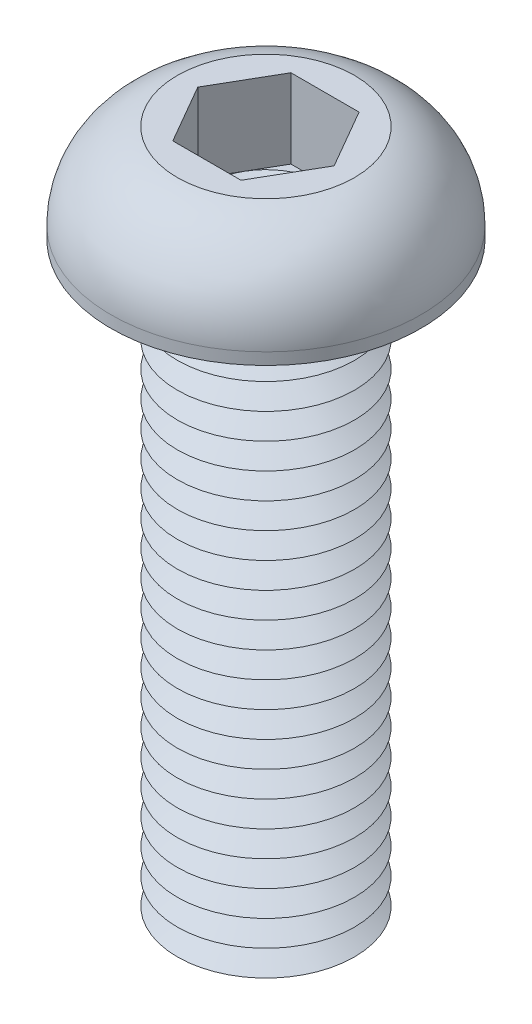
ISO-10303-21;
HEADER;
FILE_DESCRIPTION(('STEP AP214'),'2;1');
FILE_NAME('part.step','',(''),(''),'','','');
FILE_SCHEMA(('AUTOMOTIVE_DESIGN { 1 0 10303 214 1 1 1 1 }'));
ENDSEC;
DATA;
#1=APPLICATION_CONTEXT('core data for automotive mechanical design processes');
#2=APPLICATION_PROTOCOL_DEFINITION('international standard','automotive_design',2000,#1);
#3=PRODUCT_CONTEXT('',#1,'mechanical');
#4=PRODUCT('Part','Part','',(#3));
#5=PRODUCT_RELATED_PRODUCT_CATEGORY('part','',(#4));
#6=PRODUCT_DEFINITION_FORMATION('','',#4);
#7=PRODUCT_DEFINITION_CONTEXT('part definition',#1,'design');
#8=PRODUCT_DEFINITION('design','',#6,#7);
#9=PRODUCT_DEFINITION_SHAPE('','',#8);
#10=(LENGTH_UNIT() NAMED_UNIT(*) SI_UNIT(.MILLI.,.METRE.));
#11=(NAMED_UNIT(*) PLANE_ANGLE_UNIT() SI_UNIT($,.RADIAN.));
#12=(NAMED_UNIT(*) SI_UNIT($,.STERADIAN.) SOLID_ANGLE_UNIT());
#13=UNCERTAINTY_MEASURE_WITH_UNIT(LENGTH_MEASURE(1.E-05),#10,'distance_accuracy_value','');
#14=(GEOMETRIC_REPRESENTATION_CONTEXT(3) GLOBAL_UNCERTAINTY_ASSIGNED_CONTEXT((#13)) GLOBAL_UNIT_ASSIGNED_CONTEXT((#10,
#11,#12)) REPRESENTATION_CONTEXT('',''));
#15=CARTESIAN_POINT('',(0.,0.,0.));
#16=DIRECTION('',(0.,0.,1.));
#17=DIRECTION('',(1.,0.,0.));
#18=AXIS2_PLACEMENT_3D('',#15,#16,#17);
#19=CARTESIAN_POINT('',(0.,0.,0.));
#20=DIRECTION('',(0.,-1.,0.));
#21=DIRECTION('',(0.,0.,-1.));
#22=AXIS2_PLACEMENT_3D('',#19,#20,#21);
#23=TOROIDAL_SURFACE('',#22,6.875,0.875);
#24=CARTESIAN_POINT('',(0.,0.,-7.75));
#25=VERTEX_POINT('',#24);
#26=VERTEX_LOOP('',#25);
#27=FACE_BOUND('',#26,.T.);
#28=ADVANCED_FACE('P0_F12',(#27),#23,.T.);
#29=CLOSED_SHELL('',(#28));
#30=MANIFOLD_SOLID_BREP('P0_B1',#29);
#31=CARTESIAN_POINT('',(2.3094010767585,1.24,-4.));
#32=DIRECTION('',(0.,1.,0.));
#33=DIRECTION('',(0.,0.,1.));
#34=AXIS2_PLACEMENT_3D('',#31,#32,#33);
#35=PLANE('',#34);
#36=CARTESIAN_POINT('',(0.,1.24,0.));
#37=DIRECTION('',(0.,1.,0.));
#38=DIRECTION('',(0.,0.,1.));
#39=AXIS2_PLACEMENT_3D('',#36,#37,#38);
#40=CIRCLE('',#39,4.);
#41=CARTESIAN_POINT('',(0.,1.24,4.));
#42=VERTEX_POINT('',#41);
#43=CARTESIAN_POINT('',(3.46410161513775,1.24,2.));
#44=VERTEX_POINT('',#43);
#45=EDGE_CURVE('P1_E93',#42,#44,#40,.T.);
#46=ORIENTED_EDGE('',*,*,#45,.F.);
#47=DIRECTION('',(1.,0.,0.));
#48=VECTOR('',#47,1.);
#49=CARTESIAN_POINT('',(-2.3094010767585,1.24,4.));
#50=LINE('',#49,#48);
#51=CARTESIAN_POINT('',(2.3094010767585,1.24,4.));
#52=VERTEX_POINT('',#51);
#53=EDGE_CURVE('P1_E116',#42,#52,#50,.T.);
#54=ORIENTED_EDGE('',*,*,#53,.T.);
#55=DIRECTION('',(0.5,0.,-0.866025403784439));
#56=VECTOR('',#55,1.);
#57=CARTESIAN_POINT('',(2.3094010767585,1.24,4.));
#58=LINE('',#57,#56);
#59=EDGE_CURVE('P1_E112',#52,#44,#58,.T.);
#60=ORIENTED_EDGE('',*,*,#59,.T.);
#61=EDGE_LOOP('',(#46,#54,#60));
#62=FACE_BOUND('',#61,.T.);
#63=ADVANCED_FACE('P1_F15',(#62),#35,.T.);
#64=CARTESIAN_POINT('',(0.,1.24,0.));
#65=DIRECTION('',(0.,1.,0.));
#66=DIRECTION('',(0.,0.,1.));
#67=AXIS2_PLACEMENT_3D('',#64,#65,#66);
#68=CIRCLE('',#67,4.);
#69=CARTESIAN_POINT('',(3.46410161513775,1.24,-2.));
#70=VERTEX_POINT('',#69);
#71=EDGE_CURVE('P1_E10',#44,#70,#68,.T.);
#72=ORIENTED_EDGE('',*,*,#71,.F.);
#73=CARTESIAN_POINT('',(4.61880215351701,1.24,0.));
#74=VERTEX_POINT('',#73);
#75=EDGE_CURVE('P1_E104',#44,#74,#58,.T.);
#76=ORIENTED_EDGE('',*,*,#75,.T.);
#77=DIRECTION('',(-0.5,0.,-0.866025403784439));
#78=VECTOR('',#77,1.);
#79=CARTESIAN_POINT('',(4.61880215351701,1.24,0.));
#80=LINE('',#79,#78);
#81=EDGE_CURVE('P1_E107',#74,#70,#80,.T.);
#82=ORIENTED_EDGE('',*,*,#81,.T.);
#83=EDGE_LOOP('',(#72,#76,#82));
#84=FACE_BOUND('',#83,.T.);
#85=ADVANCED_FACE('P1_F103',(#84),#35,.T.);
#86=CARTESIAN_POINT('',(0.,1.24,-4.));
#87=VERTEX_POINT('',#86);
#88=EDGE_CURVE('P1_E24',#70,#87,#68,.T.);
#89=ORIENTED_EDGE('',*,*,#88,.F.);
#90=CARTESIAN_POINT('',(2.3094010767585,1.24,-4.));
#91=VERTEX_POINT('',#90);
#92=EDGE_CURVE('P1_E139',#70,#91,#80,.T.);
#93=ORIENTED_EDGE('',*,*,#92,.T.);
#94=DIRECTION('',(-1.,0.,0.));
#95=VECTOR('',#94,1.);
#96=CARTESIAN_POINT('',(2.3094010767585,1.24,-4.));
#97=LINE('',#96,#95);
#98=EDGE_CURVE('P1_E354',#91,#87,#97,.T.);
#99=ORIENTED_EDGE('',*,*,#98,.T.);
#100=EDGE_LOOP('',(#89,#93,#99));
#101=FACE_BOUND('',#100,.T.);
#102=ADVANCED_FACE('P1_F319',(#101),#35,.T.);
#103=CARTESIAN_POINT('',(-3.46410161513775,1.24,-2.));
#104=VERTEX_POINT('',#103);
#105=EDGE_CURVE('P1_E349',#87,#104,#68,.T.);
#106=ORIENTED_EDGE('',*,*,#105,.F.);
#107=CARTESIAN_POINT('',(-2.3094010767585,1.24,-4.));
#108=VERTEX_POINT('',#107);
#109=EDGE_CURVE('P1_E358',#87,#108,#97,.T.);
#110=ORIENTED_EDGE('',*,*,#109,.T.);
#111=DIRECTION('',(-0.5,0.,0.866025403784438));
#112=VECTOR('',#111,1.);
#113=CARTESIAN_POINT('',(-2.3094010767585,1.24,-4.));
#114=LINE('',#113,#112);
#115=EDGE_CURVE('P1_E353',#108,#104,#114,.T.);
#116=ORIENTED_EDGE('',*,*,#115,.T.);
#117=EDGE_LOOP('',(#106,#110,#116));
#118=FACE_BOUND('',#117,.T.);
#119=ADVANCED_FACE('P1_F333',(#118),#35,.T.);
#120=CARTESIAN_POINT('',(-3.46410161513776,1.24,2.));
#121=VERTEX_POINT('',#120);
#122=EDGE_CURVE('P1_E31',#104,#121,#68,.T.);
#123=ORIENTED_EDGE('',*,*,#122,.F.);
#124=CARTESIAN_POINT('',(-4.61880215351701,1.24,0.));
#125=VERTEX_POINT('',#124);
#126=EDGE_CURVE('P1_E345',#104,#125,#114,.T.);
#127=ORIENTED_EDGE('',*,*,#126,.T.);
#128=DIRECTION('',(0.5,0.,0.866025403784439));
#129=VECTOR('',#128,1.);
#130=CARTESIAN_POINT('',(-4.61880215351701,1.24,0.));
#131=LINE('',#130,#129);
#132=EDGE_CURVE('P1_E348',#125,#121,#131,.T.);
#133=ORIENTED_EDGE('',*,*,#132,.T.);
#134=EDGE_LOOP('',(#123,#127,#133));
#135=FACE_BOUND('',#134,.T.);
#136=ADVANCED_FACE('P1_F324',(#135),#35,.T.);
#137=CARTESIAN_POINT('',(0.,-38.25,0.));
#138=DIRECTION('',(0.,1.,0.));
#139=DIRECTION('',(0.,0.,1.));
#140=AXIS2_PLACEMENT_3D('',#137,#138,#139);
#141=CONICAL_SURFACE('',#140,4.48445554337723,1.0471975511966);
#142=CARTESIAN_POINT('',(0.,-37.375,0.));
#143=DIRECTION('',(0.,-1.,0.));
#144=DIRECTION('',(0.,0.,-1.));
#145=AXIS2_PLACEMENT_3D('',#142,#143,#144);
#146=CIRCLE('',#145,6.);
#147=CARTESIAN_POINT('',(0.,-37.375,-6.));
#148=VERTEX_POINT('',#147);
#149=EDGE_CURVE('P1_E281',#148,#148,#146,.T.);
#150=ORIENTED_EDGE('',*,*,#149,.T.);
#151=EDGE_LOOP('',(#150));
#152=FACE_BOUND('',#151,.T.);
#153=CARTESIAN_POINT('',(0.,-38.25,0.));
#154=DIRECTION('',(0.,-1.,0.));
#155=DIRECTION('',(0.,0.,-1.));
#156=AXIS2_PLACEMENT_3D('',#153,#154,#155);
#157=CIRCLE('',#156,4.48445554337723);
#158=CARTESIAN_POINT('',(0.,-38.25,-4.48445554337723));
#159=VERTEX_POINT('',#158);
#160=EDGE_CURVE('P1_E284',#159,#159,#157,.T.);
#161=ORIENTED_EDGE('',*,*,#160,.F.);
#162=EDGE_LOOP('',(#161));
#163=FACE_BOUND('',#162,.T.);
#164=ADVANCED_FACE('P1_F332',(#152,#163),#141,.T.);
#165=CARTESIAN_POINT('',(0.,-39.125,0.));
#166=DIRECTION('',(0.,-1.,0.));
#167=DIRECTION('',(0.,0.,-1.));
#168=AXIS2_PLACEMENT_3D('',#165,#166,#167);
#169=CONICAL_SURFACE('',#168,6.,1.0471975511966);
#170=ORIENTED_EDGE('',*,*,#160,.T.);
#171=EDGE_LOOP('',(#170));
#172=FACE_BOUND('',#171,.T.);
#173=CARTESIAN_POINT('',(0.,-39.125,0.));
#174=DIRECTION('',(0.,-1.,0.));
#175=DIRECTION('',(0.,0.,-1.));
#176=AXIS2_PLACEMENT_3D('',#173,#174,#175);
#177=CIRCLE('',#176,6.);
#178=CARTESIAN_POINT('',(0.,-39.125,-6.));
#179=VERTEX_POINT('',#178);
#180=EDGE_CURVE('P1_E287',#179,#179,#177,.T.);
#181=ORIENTED_EDGE('',*,*,#180,.F.);
#182=EDGE_LOOP('',(#181));
#183=FACE_BOUND('',#182,.T.);
#184=ADVANCED_FACE('P1_F339',(#172,#183),#169,.T.);
#185=CARTESIAN_POINT('',(0.,-40.,0.));
#186=DIRECTION('',(0.,1.,0.));
#187=DIRECTION('',(0.,0.,1.));
#188=AXIS2_PLACEMENT_3D('',#185,#186,#187);
#189=PLANE('',#188);
#190=CARTESIAN_POINT('',(0.,-40.,0.));
#191=DIRECTION('',(0.,-1.,0.));
#192=DIRECTION('',(0.,0.,-1.));
#193=AXIS2_PLACEMENT_3D('',#190,#191,#192);
#194=CIRCLE('',#193,4.48445554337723);
#195=CARTESIAN_POINT('',(0.,-40.,-4.48445554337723));
#196=VERTEX_POINT('',#195);
#197=EDGE_CURVE('P1_E290',#196,#196,#194,.T.);
#198=ORIENTED_EDGE('',*,*,#197,.T.);
#199=EDGE_LOOP('',(#198));
#200=FACE_BOUND('',#199,.T.);
#201=ADVANCED_FACE('P1_F417',(#200),#189,.F.);
#202=CARTESIAN_POINT('',(0.,-40.,0.));
#203=DIRECTION('',(0.,1.,0.));
#204=DIRECTION('',(0.,0.,1.));
#205=AXIS2_PLACEMENT_3D('',#202,#203,#204);
#206=CONICAL_SURFACE('',#205,4.48445554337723,1.0471975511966);
#207=ORIENTED_EDGE('',*,*,#180,.T.);
#208=EDGE_LOOP('',(#207));
#209=FACE_BOUND('',#208,.T.);
#210=ORIENTED_EDGE('',*,*,#197,.F.);
#211=EDGE_LOOP('',(#210));
#212=FACE_BOUND('',#211,.T.);
#213=ADVANCED_FACE('P1_F428',(#209,#212),#206,.T.);
#214=CARTESIAN_POINT('',(0.,-36.5,0.));
#215=DIRECTION('',(0.,1.,0.));
#216=DIRECTION('',(0.,0.,1.));
#217=AXIS2_PLACEMENT_3D('',#214,#215,#216);
#218=CONICAL_SURFACE('',#217,4.48445554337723,1.0471975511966);
#219=CARTESIAN_POINT('',(0.,-35.625,0.));
#220=DIRECTION('',(0.,-1.,0.));
#221=DIRECTION('',(0.,0.,-1.));
#222=AXIS2_PLACEMENT_3D('',#219,#220,#221);
#223=CIRCLE('',#222,6.);
#224=CARTESIAN_POINT('',(0.,-35.625,-6.));
#225=VERTEX_POINT('',#224);
#226=EDGE_CURVE('P1_E275',#225,#225,#223,.T.);
#227=ORIENTED_EDGE('',*,*,#226,.T.);
#228=EDGE_LOOP('',(#227));
#229=FACE_BOUND('',#228,.T.);
#230=CARTESIAN_POINT('',(0.,-36.5,0.));
#231=DIRECTION('',(0.,-1.,0.));
#232=DIRECTION('',(0.,0.,-1.));
#233=AXIS2_PLACEMENT_3D('',#230,#231,#232);
#234=CIRCLE('',#233,4.48445554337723);
#235=CARTESIAN_POINT('',(0.,-36.5,-4.48445554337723));
#236=VERTEX_POINT('',#235);
#237=EDGE_CURVE('P1_E278',#236,#236,#234,.T.);
#238=ORIENTED_EDGE('',*,*,#237,.F.);
#239=EDGE_LOOP('',(#238));
#240=FACE_BOUND('',#239,.T.);
#241=ADVANCED_FACE('P1_F437',(#229,#240),#218,.T.);
#242=CARTESIAN_POINT('',(0.,-37.375,0.));
#243=DIRECTION('',(0.,-1.,0.));
#244=DIRECTION('',(0.,0.,-1.));
#245=AXIS2_PLACEMENT_3D('',#242,#243,#244);
#246=CONICAL_SURFACE('',#245,6.,1.0471975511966);
#247=ORIENTED_EDGE('',*,*,#237,.T.);
#248=EDGE_LOOP('',(#247));
#249=FACE_BOUND('',#248,.T.);
#250=ORIENTED_EDGE('',*,*,#149,.F.);
#251=EDGE_LOOP('',(#250));
#252=FACE_BOUND('',#251,.T.);
#253=ADVANCED_FACE('P1_F446',(#249,#252),#246,.T.);
#254=CARTESIAN_POINT('',(0.,-34.75,0.));
#255=DIRECTION('',(0.,1.,0.));
#256=DIRECTION('',(0.,0.,1.));
#257=AXIS2_PLACEMENT_3D('',#254,#255,#256);
#258=CONICAL_SURFACE('',#257,4.48445554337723,1.0471975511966);
#259=CARTESIAN_POINT('',(0.,-33.875,0.));
#260=DIRECTION('',(0.,-1.,0.));
#261=DIRECTION('',(0.,0.,-1.));
#262=AXIS2_PLACEMENT_3D('',#259,#260,#261);
#263=CIRCLE('',#262,6.);
#264=CARTESIAN_POINT('',(0.,-33.875,-6.));
#265=VERTEX_POINT('',#264);
#266=EDGE_CURVE('P1_E269',#265,#265,#263,.T.);
#267=ORIENTED_EDGE('',*,*,#266,.T.);
#268=EDGE_LOOP('',(#267));
#269=FACE_BOUND('',#268,.T.);
#270=CARTESIAN_POINT('',(0.,-34.75,0.));
#271=DIRECTION('',(0.,-1.,0.));
#272=DIRECTION('',(0.,0.,-1.));
#273=AXIS2_PLACEMENT_3D('',#270,#271,#272);
#274=CIRCLE('',#273,4.48445554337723);
#275=CARTESIAN_POINT('',(0.,-34.75,-4.48445554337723));
#276=VERTEX_POINT('',#275);
#277=EDGE_CURVE('P1_E272',#276,#276,#274,.T.);
#278=ORIENTED_EDGE('',*,*,#277,.F.);
#279=EDGE_LOOP('',(#278));
#280=FACE_BOUND('',#279,.T.);
#281=ADVANCED_FACE('P1_F456',(#269,#280),#258,.T.);
#282=CARTESIAN_POINT('',(0.,-35.625,0.));
#283=DIRECTION('',(0.,-1.,0.));
#284=DIRECTION('',(0.,0.,-1.));
#285=AXIS2_PLACEMENT_3D('',#282,#283,#284);
#286=CONICAL_SURFACE('',#285,6.,1.0471975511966);
#287=ORIENTED_EDGE('',*,*,#277,.T.);
#288=EDGE_LOOP('',(#287));
#289=FACE_BOUND('',#288,.T.);
#290=ORIENTED_EDGE('',*,*,#226,.F.);
#291=EDGE_LOOP('',(#290));
#292=FACE_BOUND('',#291,.T.);
#293=ADVANCED_FACE('P1_F466',(#289,#292),#286,.T.);
#294=CARTESIAN_POINT('',(0.,-33.,0.));
#295=DIRECTION('',(0.,1.,0.));
#296=DIRECTION('',(0.,0.,1.));
#297=AXIS2_PLACEMENT_3D('',#294,#295,#296);
#298=CONICAL_SURFACE('',#297,4.48445554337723,1.0471975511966);
#299=CARTESIAN_POINT('',(0.,-32.125,0.));
#300=DIRECTION('',(0.,-1.,0.));
#301=DIRECTION('',(0.,0.,-1.));
#302=AXIS2_PLACEMENT_3D('',#299,#300,#301);
#303=CIRCLE('',#302,6.);
#304=CARTESIAN_POINT('',(0.,-32.125,-6.));
#305=VERTEX_POINT('',#304);
#306=EDGE_CURVE('P1_E263',#305,#305,#303,.T.);
#307=ORIENTED_EDGE('',*,*,#306,.T.);
#308=EDGE_LOOP('',(#307));
#309=FACE_BOUND('',#308,.T.);
#310=CARTESIAN_POINT('',(0.,-33.,0.));
#311=DIRECTION('',(0.,-1.,0.));
#312=DIRECTION('',(0.,0.,-1.));
#313=AXIS2_PLACEMENT_3D('',#310,#311,#312);
#314=CIRCLE('',#313,4.48445554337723);
#315=CARTESIAN_POINT('',(0.,-33.,-4.48445554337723));
#316=VERTEX_POINT('',#315);
#317=EDGE_CURVE('P1_E266',#316,#316,#314,.T.);
#318=ORIENTED_EDGE('',*,*,#317,.F.);
#319=EDGE_LOOP('',(#318));
#320=FACE_BOUND('',#319,.T.);
#321=ADVANCED_FACE('P1_F476',(#309,#320),#298,.T.);
#322=CARTESIAN_POINT('',(0.,-33.875,0.));
#323=DIRECTION('',(0.,-1.,0.));
#324=DIRECTION('',(0.,0.,-1.));
#325=AXIS2_PLACEMENT_3D('',#322,#323,#324);
#326=CONICAL_SURFACE('',#325,6.,1.0471975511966);
#327=ORIENTED_EDGE('',*,*,#317,.T.);
#328=EDGE_LOOP('',(#327));
#329=FACE_BOUND('',#328,.T.);
#330=ORIENTED_EDGE('',*,*,#266,.F.);
#331=EDGE_LOOP('',(#330));
#332=FACE_BOUND('',#331,.T.);
#333=ADVANCED_FACE('P1_F486',(#329,#332),#326,.T.);
#334=CARTESIAN_POINT('',(0.,-31.25,0.));
#335=DIRECTION('',(0.,1.,0.));
#336=DIRECTION('',(0.,0.,1.));
#337=AXIS2_PLACEMENT_3D('',#334,#335,#336);
#338=CONICAL_SURFACE('',#337,4.48445554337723,1.0471975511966);
#339=CARTESIAN_POINT('',(0.,-30.375,0.));
#340=DIRECTION('',(0.,-1.,0.));
#341=DIRECTION('',(0.,0.,-1.));
#342=AXIS2_PLACEMENT_3D('',#339,#340,#341);
#343=CIRCLE('',#342,6.);
#344=CARTESIAN_POINT('',(0.,-30.375,-6.));
#345=VERTEX_POINT('',#344);
#346=EDGE_CURVE('P1_E257',#345,#345,#343,.T.);
#347=ORIENTED_EDGE('',*,*,#346,.T.);
#348=EDGE_LOOP('',(#347));
#349=FACE_BOUND('',#348,.T.);
#350=CARTESIAN_POINT('',(0.,-31.25,0.));
#351=DIRECTION('',(0.,-1.,0.));
#352=DIRECTION('',(0.,0.,-1.));
#353=AXIS2_PLACEMENT_3D('',#350,#351,#352);
#354=CIRCLE('',#353,4.48445554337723);
#355=CARTESIAN_POINT('',(0.,-31.25,-4.48445554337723));
#356=VERTEX_POINT('',#355);
#357=EDGE_CURVE('P1_E260',#356,#356,#354,.T.);
#358=ORIENTED_EDGE('',*,*,#357,.F.);
#359=EDGE_LOOP('',(#358));
#360=FACE_BOUND('',#359,.T.);
#361=ADVANCED_FACE('P1_F496',(#349,#360),#338,.T.);
#362=CARTESIAN_POINT('',(0.,-32.125,0.));
#363=DIRECTION('',(0.,-1.,0.));
#364=DIRECTION('',(0.,0.,-1.));
#365=AXIS2_PLACEMENT_3D('',#362,#363,#364);
#366=CONICAL_SURFACE('',#365,6.,1.0471975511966);
#367=ORIENTED_EDGE('',*,*,#357,.T.);
#368=EDGE_LOOP('',(#367));
#369=FACE_BOUND('',#368,.T.);
#370=ORIENTED_EDGE('',*,*,#306,.F.);
#371=EDGE_LOOP('',(#370));
#372=FACE_BOUND('',#371,.T.);
#373=ADVANCED_FACE('P1_F506',(#369,#372),#366,.T.);
#374=CARTESIAN_POINT('',(0.,-29.5,0.));
#375=DIRECTION('',(0.,1.,0.));
#376=DIRECTION('',(0.,0.,1.));
#377=AXIS2_PLACEMENT_3D('',#374,#375,#376);
#378=CONICAL_SURFACE('',#377,4.48445554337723,1.0471975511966);
#379=CARTESIAN_POINT('',(0.,-28.625,0.));
#380=DIRECTION('',(0.,-1.,0.));
#381=DIRECTION('',(0.,0.,-1.));
#382=AXIS2_PLACEMENT_3D('',#379,#380,#381);
#383=CIRCLE('',#382,6.);
#384=CARTESIAN_POINT('',(0.,-28.625,-6.));
#385=VERTEX_POINT('',#384);
#386=EDGE_CURVE('P1_E251',#385,#385,#383,.T.);
#387=ORIENTED_EDGE('',*,*,#386,.T.);
#388=EDGE_LOOP('',(#387));
#389=FACE_BOUND('',#388,.T.);
#390=CARTESIAN_POINT('',(0.,-29.5,0.));
#391=DIRECTION('',(0.,-1.,0.));
#392=DIRECTION('',(0.,0.,-1.));
#393=AXIS2_PLACEMENT_3D('',#390,#391,#392);
#394=CIRCLE('',#393,4.48445554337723);
#395=CARTESIAN_POINT('',(0.,-29.5,-4.48445554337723));
#396=VERTEX_POINT('',#395);
#397=EDGE_CURVE('P1_E254',#396,#396,#394,.T.);
#398=ORIENTED_EDGE('',*,*,#397,.F.);
#399=EDGE_LOOP('',(#398));
#400=FACE_BOUND('',#399,.T.);
#401=ADVANCED_FACE('P1_F516',(#389,#400),#378,.T.);
#402=CARTESIAN_POINT('',(0.,-30.375,0.));
#403=DIRECTION('',(0.,-1.,0.));
#404=DIRECTION('',(0.,0.,-1.));
#405=AXIS2_PLACEMENT_3D('',#402,#403,#404);
#406=CONICAL_SURFACE('',#405,6.,1.0471975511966);
#407=ORIENTED_EDGE('',*,*,#397,.T.);
#408=EDGE_LOOP('',(#407));
#409=FACE_BOUND('',#408,.T.);
#410=ORIENTED_EDGE('',*,*,#346,.F.);
#411=EDGE_LOOP('',(#410));
#412=FACE_BOUND('',#411,.T.);
#413=ADVANCED_FACE('P1_F526',(#409,#412),#406,.T.);
#414=CARTESIAN_POINT('',(0.,-27.75,0.));
#415=DIRECTION('',(0.,1.,0.));
#416=DIRECTION('',(0.,0.,1.));
#417=AXIS2_PLACEMENT_3D('',#414,#415,#416);
#418=CONICAL_SURFACE('',#417,4.48445554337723,1.0471975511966);
#419=CARTESIAN_POINT('',(0.,-26.875,0.));
#420=DIRECTION('',(0.,-1.,0.));
#421=DIRECTION('',(0.,0.,-1.));
#422=AXIS2_PLACEMENT_3D('',#419,#420,#421);
#423=CIRCLE('',#422,6.);
#424=CARTESIAN_POINT('',(0.,-26.875,-6.));
#425=VERTEX_POINT('',#424);
#426=EDGE_CURVE('P1_E245',#425,#425,#423,.T.);
#427=ORIENTED_EDGE('',*,*,#426,.T.);
#428=EDGE_LOOP('',(#427));
#429=FACE_BOUND('',#428,.T.);
#430=CARTESIAN_POINT('',(0.,-27.75,0.));
#431=DIRECTION('',(0.,-1.,0.));
#432=DIRECTION('',(0.,0.,-1.));
#433=AXIS2_PLACEMENT_3D('',#430,#431,#432);
#434=CIRCLE('',#433,4.48445554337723);
#435=CARTESIAN_POINT('',(0.,-27.75,-4.48445554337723));
#436=VERTEX_POINT('',#435);
#437=EDGE_CURVE('P1_E248',#436,#436,#434,.T.);
#438=ORIENTED_EDGE('',*,*,#437,.F.);
#439=EDGE_LOOP('',(#438));
#440=FACE_BOUND('',#439,.T.);
#441=ADVANCED_FACE('P1_F536',(#429,#440),#418,.T.);
#442=CARTESIAN_POINT('',(0.,-28.625,0.));
#443=DIRECTION('',(0.,-1.,0.));
#444=DIRECTION('',(0.,0.,-1.));
#445=AXIS2_PLACEMENT_3D('',#442,#443,#444);
#446=CONICAL_SURFACE('',#445,6.,1.0471975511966);
#447=ORIENTED_EDGE('',*,*,#437,.T.);
#448=EDGE_LOOP('',(#447));
#449=FACE_BOUND('',#448,.T.);
#450=ORIENTED_EDGE('',*,*,#386,.F.);
#451=EDGE_LOOP('',(#450));
#452=FACE_BOUND('',#451,.T.);
#453=ADVANCED_FACE('P1_F546',(#449,#452),#446,.T.);
#454=CARTESIAN_POINT('',(0.,-26.,0.));
#455=DIRECTION('',(0.,1.,0.));
#456=DIRECTION('',(0.,0.,1.));
#457=AXIS2_PLACEMENT_3D('',#454,#455,#456);
#458=CONICAL_SURFACE('',#457,4.48445554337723,1.0471975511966);
#459=CARTESIAN_POINT('',(0.,-25.125,0.));
#460=DIRECTION('',(0.,-1.,0.));
#461=DIRECTION('',(0.,0.,-1.));
#462=AXIS2_PLACEMENT_3D('',#459,#460,#461);
#463=CIRCLE('',#462,6.);
#464=CARTESIAN_POINT('',(0.,-25.125,-6.));
#465=VERTEX_POINT('',#464);
#466=EDGE_CURVE('P1_E239',#465,#465,#463,.T.);
#467=ORIENTED_EDGE('',*,*,#466,.T.);
#468=EDGE_LOOP('',(#467));
#469=FACE_BOUND('',#468,.T.);
#470=CARTESIAN_POINT('',(0.,-26.,0.));
#471=DIRECTION('',(0.,-1.,0.));
#472=DIRECTION('',(0.,0.,-1.));
#473=AXIS2_PLACEMENT_3D('',#470,#471,#472);
#474=CIRCLE('',#473,4.48445554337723);
#475=CARTESIAN_POINT('',(0.,-26.,-4.48445554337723));
#476=VERTEX_POINT('',#475);
#477=EDGE_CURVE('P1_E242',#476,#476,#474,.T.);
#478=ORIENTED_EDGE('',*,*,#477,.F.);
#479=EDGE_LOOP('',(#478));
#480=FACE_BOUND('',#479,.T.);
#481=ADVANCED_FACE('P1_F556',(#469,#480),#458,.T.);
#482=CARTESIAN_POINT('',(0.,-26.875,0.));
#483=DIRECTION('',(0.,-1.,0.));
#484=DIRECTION('',(0.,0.,-1.));
#485=AXIS2_PLACEMENT_3D('',#482,#483,#484);
#486=CONICAL_SURFACE('',#485,6.,1.0471975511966);
#487=ORIENTED_EDGE('',*,*,#477,.T.);
#488=EDGE_LOOP('',(#487));
#489=FACE_BOUND('',#488,.T.);
#490=ORIENTED_EDGE('',*,*,#426,.F.);
#491=EDGE_LOOP('',(#490));
#492=FACE_BOUND('',#491,.T.);
#493=ADVANCED_FACE('P1_F566',(#489,#492),#486,.T.);
#494=CARTESIAN_POINT('',(0.,-24.25,0.));
#495=DIRECTION('',(0.,1.,0.));
#496=DIRECTION('',(0.,0.,1.));
#497=AXIS2_PLACEMENT_3D('',#494,#495,#496);
#498=CONICAL_SURFACE('',#497,4.48445554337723,1.0471975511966);
#499=CARTESIAN_POINT('',(0.,-23.375,0.));
#500=DIRECTION('',(0.,-1.,0.));
#501=DIRECTION('',(0.,0.,-1.));
#502=AXIS2_PLACEMENT_3D('',#499,#500,#501);
#503=CIRCLE('',#502,6.);
#504=CARTESIAN_POINT('',(0.,-23.375,-6.));
#505=VERTEX_POINT('',#504);
#506=EDGE_CURVE('P1_E233',#505,#505,#503,.T.);
#507=ORIENTED_EDGE('',*,*,#506,.T.);
#508=EDGE_LOOP('',(#507));
#509=FACE_BOUND('',#508,.T.);
#510=CARTESIAN_POINT('',(0.,-24.25,0.));
#511=DIRECTION('',(0.,-1.,0.));
#512=DIRECTION('',(0.,0.,-1.));
#513=AXIS2_PLACEMENT_3D('',#510,#511,#512);
#514=CIRCLE('',#513,4.48445554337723);
#515=CARTESIAN_POINT('',(0.,-24.25,-4.48445554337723));
#516=VERTEX_POINT('',#515);
#517=EDGE_CURVE('P1_E236',#516,#516,#514,.T.);
#518=ORIENTED_EDGE('',*,*,#517,.F.);
#519=EDGE_LOOP('',(#518));
#520=FACE_BOUND('',#519,.T.);
#521=ADVANCED_FACE('P1_F576',(#509,#520),#498,.T.);
#522=CARTESIAN_POINT('',(0.,-25.125,0.));
#523=DIRECTION('',(0.,-1.,0.));
#524=DIRECTION('',(0.,0.,-1.));
#525=AXIS2_PLACEMENT_3D('',#522,#523,#524);
#526=CONICAL_SURFACE('',#525,6.,1.0471975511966);
#527=ORIENTED_EDGE('',*,*,#517,.T.);
#528=EDGE_LOOP('',(#527));
#529=FACE_BOUND('',#528,.T.);
#530=ORIENTED_EDGE('',*,*,#466,.F.);
#531=EDGE_LOOP('',(#530));
#532=FACE_BOUND('',#531,.T.);
#533=ADVANCED_FACE('P1_F586',(#529,#532),#526,.T.);
#534=CARTESIAN_POINT('',(0.,-22.5,0.));
#535=DIRECTION('',(0.,1.,0.));
#536=DIRECTION('',(0.,0.,1.));
#537=AXIS2_PLACEMENT_3D('',#534,#535,#536);
#538=CONICAL_SURFACE('',#537,4.48445554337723,1.0471975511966);
#539=CARTESIAN_POINT('',(0.,-21.625,0.));
#540=DIRECTION('',(0.,-1.,0.));
#541=DIRECTION('',(0.,0.,-1.));
#542=AXIS2_PLACEMENT_3D('',#539,#540,#541);
#543=CIRCLE('',#542,6.);
#544=CARTESIAN_POINT('',(0.,-21.625,-6.));
#545=VERTEX_POINT('',#544);
#546=EDGE_CURVE('P1_E227',#545,#545,#543,.T.);
#547=ORIENTED_EDGE('',*,*,#546,.T.);
#548=EDGE_LOOP('',(#547));
#549=FACE_BOUND('',#548,.T.);
#550=CARTESIAN_POINT('',(0.,-22.5,0.));
#551=DIRECTION('',(0.,-1.,0.));
#552=DIRECTION('',(0.,0.,-1.));
#553=AXIS2_PLACEMENT_3D('',#550,#551,#552);
#554=CIRCLE('',#553,4.48445554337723);
#555=CARTESIAN_POINT('',(0.,-22.5,-4.48445554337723));
#556=VERTEX_POINT('',#555);
#557=EDGE_CURVE('P1_E230',#556,#556,#554,.T.);
#558=ORIENTED_EDGE('',*,*,#557,.F.);
#559=EDGE_LOOP('',(#558));
#560=FACE_BOUND('',#559,.T.);
#561=ADVANCED_FACE('P1_F596',(#549,#560),#538,.T.);
#562=CARTESIAN_POINT('',(0.,-23.375,0.));
#563=DIRECTION('',(0.,-1.,0.));
#564=DIRECTION('',(0.,0.,-1.));
#565=AXIS2_PLACEMENT_3D('',#562,#563,#564);
#566=CONICAL_SURFACE('',#565,6.,1.0471975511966);
#567=ORIENTED_EDGE('',*,*,#557,.T.);
#568=EDGE_LOOP('',(#567));
#569=FACE_BOUND('',#568,.T.);
#570=ORIENTED_EDGE('',*,*,#506,.F.);
#571=EDGE_LOOP('',(#570));
#572=FACE_BOUND('',#571,.T.);
#573=ADVANCED_FACE('P1_F606',(#569,#572),#566,.T.);
#574=CARTESIAN_POINT('',(0.,-20.75,0.));
#575=DIRECTION('',(0.,1.,0.));
#576=DIRECTION('',(0.,0.,1.));
#577=AXIS2_PLACEMENT_3D('',#574,#575,#576);
#578=CONICAL_SURFACE('',#577,4.48445554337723,1.0471975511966);
#579=CARTESIAN_POINT('',(0.,-19.875,0.));
#580=DIRECTION('',(0.,-1.,0.));
#581=DIRECTION('',(0.,0.,-1.));
#582=AXIS2_PLACEMENT_3D('',#579,#580,#581);
#583=CIRCLE('',#582,6.);
#584=CARTESIAN_POINT('',(0.,-19.875,-6.));
#585=VERTEX_POINT('',#584);
#586=EDGE_CURVE('P1_E221',#585,#585,#583,.T.);
#587=ORIENTED_EDGE('',*,*,#586,.T.);
#588=EDGE_LOOP('',(#587));
#589=FACE_BOUND('',#588,.T.);
#590=CARTESIAN_POINT('',(0.,-20.75,0.));
#591=DIRECTION('',(0.,-1.,0.));
#592=DIRECTION('',(0.,0.,-1.));
#593=AXIS2_PLACEMENT_3D('',#590,#591,#592);
#594=CIRCLE('',#593,4.48445554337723);
#595=CARTESIAN_POINT('',(0.,-20.75,-4.48445554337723));
#596=VERTEX_POINT('',#595);
#597=EDGE_CURVE('P1_E224',#596,#596,#594,.T.);
#598=ORIENTED_EDGE('',*,*,#597,.F.);
#599=EDGE_LOOP('',(#598));
#600=FACE_BOUND('',#599,.T.);
#601=ADVANCED_FACE('P1_F616',(#589,#600),#578,.T.);
#602=CARTESIAN_POINT('',(0.,-21.625,0.));
#603=DIRECTION('',(0.,-1.,0.));
#604=DIRECTION('',(0.,0.,-1.));
#605=AXIS2_PLACEMENT_3D('',#602,#603,#604);
#606=CONICAL_SURFACE('',#605,6.,1.0471975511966);
#607=ORIENTED_EDGE('',*,*,#597,.T.);
#608=EDGE_LOOP('',(#607));
#609=FACE_BOUND('',#608,.T.);
#610=ORIENTED_EDGE('',*,*,#546,.F.);
#611=EDGE_LOOP('',(#610));
#612=FACE_BOUND('',#611,.T.);
#613=ADVANCED_FACE('P1_F626',(#609,#612),#606,.T.);
#614=CARTESIAN_POINT('',(0.,-19.,0.));
#615=DIRECTION('',(0.,1.,0.));
#616=DIRECTION('',(0.,0.,1.));
#617=AXIS2_PLACEMENT_3D('',#614,#615,#616);
#618=CONICAL_SURFACE('',#617,4.48445554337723,1.0471975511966);
#619=CARTESIAN_POINT('',(0.,-18.125,0.));
#620=DIRECTION('',(0.,-1.,0.));
#621=DIRECTION('',(0.,0.,-1.));
#622=AXIS2_PLACEMENT_3D('',#619,#620,#621);
#623=CIRCLE('',#622,6.);
#624=CARTESIAN_POINT('',(0.,-18.125,-6.));
#625=VERTEX_POINT('',#624);
#626=EDGE_CURVE('P1_E215',#625,#625,#623,.T.);
#627=ORIENTED_EDGE('',*,*,#626,.T.);
#628=EDGE_LOOP('',(#627));
#629=FACE_BOUND('',#628,.T.);
#630=CARTESIAN_POINT('',(0.,-19.,0.));
#631=DIRECTION('',(0.,-1.,0.));
#632=DIRECTION('',(0.,0.,-1.));
#633=AXIS2_PLACEMENT_3D('',#630,#631,#632);
#634=CIRCLE('',#633,4.48445554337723);
#635=CARTESIAN_POINT('',(0.,-19.,-4.48445554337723));
#636=VERTEX_POINT('',#635);
#637=EDGE_CURVE('P1_E218',#636,#636,#634,.T.);
#638=ORIENTED_EDGE('',*,*,#637,.F.);
#639=EDGE_LOOP('',(#638));
#640=FACE_BOUND('',#639,.T.);
#641=ADVANCED_FACE('P1_F636',(#629,#640),#618,.T.);
#642=CARTESIAN_POINT('',(0.,-19.875,0.));
#643=DIRECTION('',(0.,-1.,0.));
#644=DIRECTION('',(0.,0.,-1.));
#645=AXIS2_PLACEMENT_3D('',#642,#643,#644);
#646=CONICAL_SURFACE('',#645,6.,1.0471975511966);
#647=ORIENTED_EDGE('',*,*,#637,.T.);
#648=EDGE_LOOP('',(#647));
#649=FACE_BOUND('',#648,.T.);
#650=ORIENTED_EDGE('',*,*,#586,.F.);
#651=EDGE_LOOP('',(#650));
#652=FACE_BOUND('',#651,.T.);
#653=ADVANCED_FACE('P1_F646',(#649,#652),#646,.T.);
#654=CARTESIAN_POINT('',(0.,-17.25,0.));
#655=DIRECTION('',(0.,1.,0.));
#656=DIRECTION('',(0.,0.,1.));
#657=AXIS2_PLACEMENT_3D('',#654,#655,#656);
#658=CONICAL_SURFACE('',#657,4.48445554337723,1.0471975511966);
#659=CARTESIAN_POINT('',(0.,-16.375,0.));
#660=DIRECTION('',(0.,-1.,0.));
#661=DIRECTION('',(0.,0.,-1.));
#662=AXIS2_PLACEMENT_3D('',#659,#660,#661);
#663=CIRCLE('',#662,6.);
#664=CARTESIAN_POINT('',(0.,-16.375,-6.));
#665=VERTEX_POINT('',#664);
#666=EDGE_CURVE('P1_E209',#665,#665,#663,.T.);
#667=ORIENTED_EDGE('',*,*,#666,.T.);
#668=EDGE_LOOP('',(#667));
#669=FACE_BOUND('',#668,.T.);
#670=CARTESIAN_POINT('',(0.,-17.25,0.));
#671=DIRECTION('',(0.,-1.,0.));
#672=DIRECTION('',(0.,0.,-1.));
#673=AXIS2_PLACEMENT_3D('',#670,#671,#672);
#674=CIRCLE('',#673,4.48445554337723);
#675=CARTESIAN_POINT('',(0.,-17.25,-4.48445554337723));
#676=VERTEX_POINT('',#675);
#677=EDGE_CURVE('P1_E212',#676,#676,#674,.T.);
#678=ORIENTED_EDGE('',*,*,#677,.F.);
#679=EDGE_LOOP('',(#678));
#680=FACE_BOUND('',#679,.T.);
#681=ADVANCED_FACE('P1_F656',(#669,#680),#658,.T.);
#682=CARTESIAN_POINT('',(0.,-18.125,0.));
#683=DIRECTION('',(0.,-1.,0.));
#684=DIRECTION('',(0.,0.,-1.));
#685=AXIS2_PLACEMENT_3D('',#682,#683,#684);
#686=CONICAL_SURFACE('',#685,6.,1.0471975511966);
#687=ORIENTED_EDGE('',*,*,#677,.T.);
#688=EDGE_LOOP('',(#687));
#689=FACE_BOUND('',#688,.T.);
#690=ORIENTED_EDGE('',*,*,#626,.F.);
#691=EDGE_LOOP('',(#690));
#692=FACE_BOUND('',#691,.T.);
#693=ADVANCED_FACE('P1_F666',(#689,#692),#686,.T.);
#694=CARTESIAN_POINT('',(0.,-15.5,0.));
#695=DIRECTION('',(0.,1.,0.));
#696=DIRECTION('',(0.,0.,1.));
#697=AXIS2_PLACEMENT_3D('',#694,#695,#696);
#698=CONICAL_SURFACE('',#697,4.48445554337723,1.0471975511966);
#699=CARTESIAN_POINT('',(0.,-14.625,0.));
#700=DIRECTION('',(0.,-1.,0.));
#701=DIRECTION('',(0.,0.,-1.));
#702=AXIS2_PLACEMENT_3D('',#699,#700,#701);
#703=CIRCLE('',#702,6.);
#704=CARTESIAN_POINT('',(0.,-14.625,-6.));
#705=VERTEX_POINT('',#704);
#706=EDGE_CURVE('P1_E203',#705,#705,#703,.T.);
#707=ORIENTED_EDGE('',*,*,#706,.T.);
#708=EDGE_LOOP('',(#707));
#709=FACE_BOUND('',#708,.T.);
#710=CARTESIAN_POINT('',(0.,-15.5,0.));
#711=DIRECTION('',(0.,-1.,0.));
#712=DIRECTION('',(0.,0.,-1.));
#713=AXIS2_PLACEMENT_3D('',#710,#711,#712);
#714=CIRCLE('',#713,4.48445554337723);
#715=CARTESIAN_POINT('',(0.,-15.5,-4.48445554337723));
#716=VERTEX_POINT('',#715);
#717=EDGE_CURVE('P1_E206',#716,#716,#714,.T.);
#718=ORIENTED_EDGE('',*,*,#717,.F.);
#719=EDGE_LOOP('',(#718));
#720=FACE_BOUND('',#719,.T.);
#721=ADVANCED_FACE('P1_F676',(#709,#720),#698,.T.);
#722=CARTESIAN_POINT('',(0.,-16.375,0.));
#723=DIRECTION('',(0.,-1.,0.));
#724=DIRECTION('',(0.,0.,-1.));
#725=AXIS2_PLACEMENT_3D('',#722,#723,#724);
#726=CONICAL_SURFACE('',#725,6.,1.0471975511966);
#727=ORIENTED_EDGE('',*,*,#717,.T.);
#728=EDGE_LOOP('',(#727));
#729=FACE_BOUND('',#728,.T.);
#730=ORIENTED_EDGE('',*,*,#666,.F.);
#731=EDGE_LOOP('',(#730));
#732=FACE_BOUND('',#731,.T.);
#733=ADVANCED_FACE('P1_F686',(#729,#732),#726,.T.);
#734=CARTESIAN_POINT('',(0.,-13.75,0.));
#735=DIRECTION('',(0.,1.,0.));
#736=DIRECTION('',(0.,0.,1.));
#737=AXIS2_PLACEMENT_3D('',#734,#735,#736);
#738=CONICAL_SURFACE('',#737,4.48445554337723,1.0471975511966);
#739=CARTESIAN_POINT('',(0.,-12.875,0.));
#740=DIRECTION('',(0.,-1.,0.));
#741=DIRECTION('',(0.,0.,-1.));
#742=AXIS2_PLACEMENT_3D('',#739,#740,#741);
#743=CIRCLE('',#742,6.);
#744=CARTESIAN_POINT('',(0.,-12.875,-6.));
#745=VERTEX_POINT('',#744);
#746=EDGE_CURVE('P1_E197',#745,#745,#743,.T.);
#747=ORIENTED_EDGE('',*,*,#746,.T.);
#748=EDGE_LOOP('',(#747));
#749=FACE_BOUND('',#748,.T.);
#750=CARTESIAN_POINT('',(0.,-13.75,0.));
#751=DIRECTION('',(0.,-1.,0.));
#752=DIRECTION('',(0.,0.,-1.));
#753=AXIS2_PLACEMENT_3D('',#750,#751,#752);
#754=CIRCLE('',#753,4.48445554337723);
#755=CARTESIAN_POINT('',(0.,-13.75,-4.48445554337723));
#756=VERTEX_POINT('',#755);
#757=EDGE_CURVE('P1_E200',#756,#756,#754,.T.);
#758=ORIENTED_EDGE('',*,*,#757,.F.);
#759=EDGE_LOOP('',(#758));
#760=FACE_BOUND('',#759,.T.);
#761=ADVANCED_FACE('P1_F696',(#749,#760),#738,.T.);
#762=CARTESIAN_POINT('',(0.,-14.625,0.));
#763=DIRECTION('',(0.,-1.,0.));
#764=DIRECTION('',(0.,0.,-1.));
#765=AXIS2_PLACEMENT_3D('',#762,#763,#764);
#766=CONICAL_SURFACE('',#765,6.,1.0471975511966);
#767=ORIENTED_EDGE('',*,*,#757,.T.);
#768=EDGE_LOOP('',(#767));
#769=FACE_BOUND('',#768,.T.);
#770=ORIENTED_EDGE('',*,*,#706,.F.);
#771=EDGE_LOOP('',(#770));
#772=FACE_BOUND('',#771,.T.);
#773=ADVANCED_FACE('P1_F706',(#769,#772),#766,.T.);
#774=CARTESIAN_POINT('',(0.,-12.,0.));
#775=DIRECTION('',(0.,1.,0.));
#776=DIRECTION('',(0.,0.,1.));
#777=AXIS2_PLACEMENT_3D('',#774,#775,#776);
#778=CONICAL_SURFACE('',#777,4.48445554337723,1.0471975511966);
#779=CARTESIAN_POINT('',(0.,-11.125,0.));
#780=DIRECTION('',(0.,-1.,0.));
#781=DIRECTION('',(0.,0.,-1.));
#782=AXIS2_PLACEMENT_3D('',#779,#780,#781);
#783=CIRCLE('',#782,6.);
#784=CARTESIAN_POINT('',(0.,-11.125,-6.));
#785=VERTEX_POINT('',#784);
#786=EDGE_CURVE('P1_E191',#785,#785,#783,.T.);
#787=ORIENTED_EDGE('',*,*,#786,.T.);
#788=EDGE_LOOP('',(#787));
#789=FACE_BOUND('',#788,.T.);
#790=CARTESIAN_POINT('',(0.,-12.,0.));
#791=DIRECTION('',(0.,-1.,0.));
#792=DIRECTION('',(0.,0.,-1.));
#793=AXIS2_PLACEMENT_3D('',#790,#791,#792);
#794=CIRCLE('',#793,4.48445554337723);
#795=CARTESIAN_POINT('',(0.,-12.,-4.48445554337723));
#796=VERTEX_POINT('',#795);
#797=EDGE_CURVE('P1_E194',#796,#796,#794,.T.);
#798=ORIENTED_EDGE('',*,*,#797,.F.);
#799=EDGE_LOOP('',(#798));
#800=FACE_BOUND('',#799,.T.);
#801=ADVANCED_FACE('P1_F716',(#789,#800),#778,.T.);
#802=CARTESIAN_POINT('',(0.,-12.875,0.));
#803=DIRECTION('',(0.,-1.,0.));
#804=DIRECTION('',(0.,0.,-1.));
#805=AXIS2_PLACEMENT_3D('',#802,#803,#804);
#806=CONICAL_SURFACE('',#805,6.,1.0471975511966);
#807=ORIENTED_EDGE('',*,*,#797,.T.);
#808=EDGE_LOOP('',(#807));
#809=FACE_BOUND('',#808,.T.);
#810=ORIENTED_EDGE('',*,*,#746,.F.);
#811=EDGE_LOOP('',(#810));
#812=FACE_BOUND('',#811,.T.);
#813=ADVANCED_FACE('P1_F726',(#809,#812),#806,.T.);
#814=CARTESIAN_POINT('',(0.,-10.25,0.));
#815=DIRECTION('',(0.,1.,0.));
#816=DIRECTION('',(0.,0.,1.));
#817=AXIS2_PLACEMENT_3D('',#814,#815,#816);
#818=CONICAL_SURFACE('',#817,4.48445554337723,1.0471975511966);
#819=CARTESIAN_POINT('',(0.,-9.37499999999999,0.));
#820=DIRECTION('',(0.,-1.,0.));
#821=DIRECTION('',(0.,0.,-1.));
#822=AXIS2_PLACEMENT_3D('',#819,#820,#821);
#823=CIRCLE('',#822,6.);
#824=CARTESIAN_POINT('',(0.,-9.37499999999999,-6.));
#825=VERTEX_POINT('',#824);
#826=EDGE_CURVE('P1_E185',#825,#825,#823,.T.);
#827=ORIENTED_EDGE('',*,*,#826,.T.);
#828=EDGE_LOOP('',(#827));
#829=FACE_BOUND('',#828,.T.);
#830=CARTESIAN_POINT('',(0.,-10.25,0.));
#831=DIRECTION('',(0.,-1.,0.));
#832=DIRECTION('',(0.,0.,-1.));
#833=AXIS2_PLACEMENT_3D('',#830,#831,#832);
#834=CIRCLE('',#833,4.48445554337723);
#835=CARTESIAN_POINT('',(0.,-10.25,-4.48445554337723));
#836=VERTEX_POINT('',#835);
#837=EDGE_CURVE('P1_E188',#836,#836,#834,.T.);
#838=ORIENTED_EDGE('',*,*,#837,.F.);
#839=EDGE_LOOP('',(#838));
#840=FACE_BOUND('',#839,.T.);
#841=ADVANCED_FACE('P1_F736',(#829,#840),#818,.T.);
#842=CARTESIAN_POINT('',(0.,-11.125,0.));
#843=DIRECTION('',(0.,-1.,0.));
#844=DIRECTION('',(0.,0.,-1.));
#845=AXIS2_PLACEMENT_3D('',#842,#843,#844);
#846=CONICAL_SURFACE('',#845,6.,1.0471975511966);
#847=ORIENTED_EDGE('',*,*,#837,.T.);
#848=EDGE_LOOP('',(#847));
#849=FACE_BOUND('',#848,.T.);
#850=ORIENTED_EDGE('',*,*,#786,.F.);
#851=EDGE_LOOP('',(#850));
#852=FACE_BOUND('',#851,.T.);
#853=ADVANCED_FACE('P1_F746',(#849,#852),#846,.T.);
#854=CARTESIAN_POINT('',(0.,-8.5,0.));
#855=DIRECTION('',(0.,1.,0.));
#856=DIRECTION('',(0.,0.,1.));
#857=AXIS2_PLACEMENT_3D('',#854,#855,#856);
#858=CONICAL_SURFACE('',#857,4.48445554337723,1.0471975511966);
#859=CARTESIAN_POINT('',(0.,-7.625,0.));
#860=DIRECTION('',(0.,-1.,0.));
#861=DIRECTION('',(0.,0.,-1.));
#862=AXIS2_PLACEMENT_3D('',#859,#860,#861);
#863=CIRCLE('',#862,6.);
#864=CARTESIAN_POINT('',(0.,-7.625,-6.));
#865=VERTEX_POINT('',#864);
#866=EDGE_CURVE('P1_E179',#865,#865,#863,.T.);
#867=ORIENTED_EDGE('',*,*,#866,.T.);
#868=EDGE_LOOP('',(#867));
#869=FACE_BOUND('',#868,.T.);
#870=CARTESIAN_POINT('',(0.,-8.5,0.));
#871=DIRECTION('',(0.,-1.,0.));
#872=DIRECTION('',(0.,0.,-1.));
#873=AXIS2_PLACEMENT_3D('',#870,#871,#872);
#874=CIRCLE('',#873,4.48445554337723);
#875=CARTESIAN_POINT('',(0.,-8.5,-4.48445554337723));
#876=VERTEX_POINT('',#875);
#877=EDGE_CURVE('P1_E182',#876,#876,#874,.T.);
#878=ORIENTED_EDGE('',*,*,#877,.F.);
#879=EDGE_LOOP('',(#878));
#880=FACE_BOUND('',#879,.T.);
#881=ADVANCED_FACE('P1_F756',(#869,#880),#858,.T.);
#882=CARTESIAN_POINT('',(0.,-9.37499999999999,0.));
#883=DIRECTION('',(0.,-1.,0.));
#884=DIRECTION('',(0.,0.,-1.));
#885=AXIS2_PLACEMENT_3D('',#882,#883,#884);
#886=CONICAL_SURFACE('',#885,6.,1.0471975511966);
#887=ORIENTED_EDGE('',*,*,#877,.T.);
#888=EDGE_LOOP('',(#887));
#889=FACE_BOUND('',#888,.T.);
#890=ORIENTED_EDGE('',*,*,#826,.F.);
#891=EDGE_LOOP('',(#890));
#892=FACE_BOUND('',#891,.T.);
#893=ADVANCED_FACE('P1_F766',(#889,#892),#886,.T.);
#894=CARTESIAN_POINT('',(0.,-6.75,0.));
#895=DIRECTION('',(0.,1.,0.));
#896=DIRECTION('',(0.,0.,1.));
#897=AXIS2_PLACEMENT_3D('',#894,#895,#896);
#898=CONICAL_SURFACE('',#897,4.48445554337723,1.0471975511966);
#899=CARTESIAN_POINT('',(0.,-5.875,0.));
#900=DIRECTION('',(0.,-1.,0.));
#901=DIRECTION('',(0.,0.,-1.));
#902=AXIS2_PLACEMENT_3D('',#899,#900,#901);
#903=CIRCLE('',#902,6.);
#904=CARTESIAN_POINT('',(0.,-5.875,-6.));
#905=VERTEX_POINT('',#904);
#906=EDGE_CURVE('P1_E173',#905,#905,#903,.T.);
#907=ORIENTED_EDGE('',*,*,#906,.T.);
#908=EDGE_LOOP('',(#907));
#909=FACE_BOUND('',#908,.T.);
#910=CARTESIAN_POINT('',(0.,-6.75,0.));
#911=DIRECTION('',(0.,-1.,0.));
#912=DIRECTION('',(0.,0.,-1.));
#913=AXIS2_PLACEMENT_3D('',#910,#911,#912);
#914=CIRCLE('',#913,4.48445554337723);
#915=CARTESIAN_POINT('',(0.,-6.75,-4.48445554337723));
#916=VERTEX_POINT('',#915);
#917=EDGE_CURVE('P1_E176',#916,#916,#914,.T.);
#918=ORIENTED_EDGE('',*,*,#917,.F.);
#919=EDGE_LOOP('',(#918));
#920=FACE_BOUND('',#919,.T.);
#921=ADVANCED_FACE('P1_F776',(#909,#920),#898,.T.);
#922=CARTESIAN_POINT('',(0.,-7.625,0.));
#923=DIRECTION('',(0.,-1.,0.));
#924=DIRECTION('',(0.,0.,-1.));
#925=AXIS2_PLACEMENT_3D('',#922,#923,#924);
#926=CONICAL_SURFACE('',#925,6.,1.0471975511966);
#927=ORIENTED_EDGE('',*,*,#917,.T.);
#928=EDGE_LOOP('',(#927));
#929=FACE_BOUND('',#928,.T.);
#930=ORIENTED_EDGE('',*,*,#866,.F.);
#931=EDGE_LOOP('',(#930));
#932=FACE_BOUND('',#931,.T.);
#933=ADVANCED_FACE('P1_F786',(#929,#932),#926,.T.);
#934=CARTESIAN_POINT('',(0.,-5.,0.));
#935=DIRECTION('',(0.,1.,0.));
#936=DIRECTION('',(0.,0.,1.));
#937=AXIS2_PLACEMENT_3D('',#934,#935,#936);
#938=CONICAL_SURFACE('',#937,4.48445554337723,1.0471975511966);
#939=CARTESIAN_POINT('',(0.,-4.125,0.));
#940=DIRECTION('',(0.,-1.,0.));
#941=DIRECTION('',(0.,0.,-1.));
#942=AXIS2_PLACEMENT_3D('',#939,#940,#941);
#943=CIRCLE('',#942,6.);
#944=CARTESIAN_POINT('',(0.,-4.125,-6.));
#945=VERTEX_POINT('',#944);
#946=EDGE_CURVE('P1_E164',#945,#945,#943,.T.);
#947=ORIENTED_EDGE('',*,*,#946,.T.);
#948=EDGE_LOOP('',(#947));
#949=FACE_BOUND('',#948,.T.);
#950=CARTESIAN_POINT('',(0.,-5.,0.));
#951=DIRECTION('',(0.,-1.,0.));
#952=DIRECTION('',(0.,0.,-1.));
#953=AXIS2_PLACEMENT_3D('',#950,#951,#952);
#954=CIRCLE('',#953,4.48445554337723);
#955=CARTESIAN_POINT('',(0.,-5.,-4.48445554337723));
#956=VERTEX_POINT('',#955);
#957=EDGE_CURVE('P1_E170',#956,#956,#954,.T.);
#958=ORIENTED_EDGE('',*,*,#957,.F.);
#959=EDGE_LOOP('',(#958));
#960=FACE_BOUND('',#959,.T.);
#961=ADVANCED_FACE('P1_F796',(#949,#960),#938,.T.);
#962=CARTESIAN_POINT('',(0.,-5.875,0.));
#963=DIRECTION('',(0.,-1.,0.));
#964=DIRECTION('',(0.,0.,-1.));
#965=AXIS2_PLACEMENT_3D('',#962,#963,#964);
#966=CONICAL_SURFACE('',#965,6.,1.0471975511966);
#967=ORIENTED_EDGE('',*,*,#957,.T.);
#968=EDGE_LOOP('',(#967));
#969=FACE_BOUND('',#968,.T.);
#970=ORIENTED_EDGE('',*,*,#906,.F.);
#971=EDGE_LOOP('',(#970));
#972=FACE_BOUND('',#971,.T.);
#973=ADVANCED_FACE('P1_F806',(#969,#972),#966,.T.);
#974=CARTESIAN_POINT('',(0.,-3.25,0.));
#975=DIRECTION('',(0.,1.,0.));
#976=DIRECTION('',(0.,0.,1.));
#977=AXIS2_PLACEMENT_3D('',#974,#975,#976);
#978=CONICAL_SURFACE('',#977,4.48445554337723,1.0471975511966);
#979=CARTESIAN_POINT('',(0.,-2.375,0.));
#980=DIRECTION('',(0.,-1.,0.));
#981=DIRECTION('',(0.,0.,-1.));
#982=AXIS2_PLACEMENT_3D('',#979,#980,#981);
#983=CIRCLE('',#982,6.);
#984=CARTESIAN_POINT('',(0.,-2.375,-6.));
#985=VERTEX_POINT('',#984);
#986=EDGE_CURVE('P1_E167',#985,#985,#983,.T.);
#987=ORIENTED_EDGE('',*,*,#986,.T.);
#988=EDGE_LOOP('',(#987));
#989=FACE_BOUND('',#988,.T.);
#990=CARTESIAN_POINT('',(0.,-3.25,0.));
#991=DIRECTION('',(0.,-1.,0.));
#992=DIRECTION('',(0.,0.,-1.));
#993=AXIS2_PLACEMENT_3D('',#990,#991,#992);
#994=CIRCLE('',#993,4.48445554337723);
#995=CARTESIAN_POINT('',(0.,-3.25,-4.48445554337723));
#996=VERTEX_POINT('',#995);
#997=EDGE_CURVE('P1_E161',#996,#996,#994,.T.);
#998=ORIENTED_EDGE('',*,*,#997,.F.);
#999=EDGE_LOOP('',(#998));
#1000=FACE_BOUND('',#999,.T.);
#1001=ADVANCED_FACE('P1_F816',(#989,#1000),#978,.T.);
#1002=CARTESIAN_POINT('',(0.,-4.125,0.));
#1003=DIRECTION('',(0.,-1.,0.));
#1004=DIRECTION('',(0.,0.,-1.));
#1005=AXIS2_PLACEMENT_3D('',#1002,#1003,#1004);
#1006=CONICAL_SURFACE('',#1005,6.,1.0471975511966);
#1007=ORIENTED_EDGE('',*,*,#997,.T.);
#1008=EDGE_LOOP('',(#1007));
#1009=FACE_BOUND('',#1008,.T.);
#1010=ORIENTED_EDGE('',*,*,#946,.F.);
#1011=EDGE_LOOP('',(#1010));
#1012=FACE_BOUND('',#1011,.T.);
#1013=ADVANCED_FACE('P1_F826',(#1009,#1012),#1006,.T.);
#1014=CARTESIAN_POINT('',(0.,-40.,0.));
#1015=DIRECTION('',(0.,1.,0.));
#1016=DIRECTION('',(0.,0.,1.));
#1017=AXIS2_PLACEMENT_3D('',#1014,#1015,#1016);
#1018=CYLINDRICAL_SURFACE('',#1017,6.);
#1019=CARTESIAN_POINT('',(0.,0.,0.));
#1020=DIRECTION('',(0.,-1.,0.));
#1021=DIRECTION('',(1.,0.,0.));
#1022=AXIS2_PLACEMENT_3D('',#1019,#1020,#1021);
#1023=CIRCLE('',#1022,6.);
#1024=CARTESIAN_POINT('',(6.,0.,0.));
#1025=VERTEX_POINT('',#1024);
#1026=EDGE_CURVE('P1_E141',#1025,#1025,#1023,.F.);
#1027=ORIENTED_EDGE('',*,*,#1026,.F.);
#1028=EDGE_LOOP('',(#1027));
#1029=FACE_BOUND('',#1028,.T.);
#1030=ORIENTED_EDGE('',*,*,#986,.F.);
#1031=EDGE_LOOP('',(#1030));
#1032=FACE_BOUND('',#1031,.T.);
#1033=ADVANCED_FACE('P1_F17',(#1029,#1032),#1018,.T.);
#1034=CARTESIAN_POINT('',(0.,0.,0.));
#1035=DIRECTION('',(0.,-1.,0.));
#1036=DIRECTION('',(0.,0.,-1.));
#1037=AXIS2_PLACEMENT_3D('',#1034,#1035,#1036);
#1038=TOROIDAL_SURFACE('',#1037,6.875,0.875);
#1039=ORIENTED_EDGE('',*,*,#1026,.T.);
#1040=EDGE_LOOP('',(#1039));
#1041=FACE_BOUND('',#1040,.T.);
#1042=CARTESIAN_POINT('',(0.,0.,0.));
#1043=DIRECTION('',(0.,1.,0.));
#1044=DIRECTION('',(-1.,0.,0.));
#1045=AXIS2_PLACEMENT_3D('',#1042,#1043,#1044);
#1046=CIRCLE('',#1045,7.75);
#1047=CARTESIAN_POINT('',(-7.75,0.,0.));
#1048=VERTEX_POINT('',#1047);
#1049=EDGE_CURVE('P1_E151',#1048,#1048,#1046,.F.);
#1050=ORIENTED_EDGE('',*,*,#1049,.T.);
#1051=EDGE_LOOP('',(#1050));
#1052=FACE_BOUND('',#1051,.T.);
#1053=ADVANCED_FACE('P1_F295',(#1041,#1052),#1038,.F.);
#1054=CARTESIAN_POINT('',(6.,6.6,0.));
#1055=DIRECTION('',(0.,-1.,0.));
#1056=DIRECTION('',(1.,0.,0.));
#1057=AXIS2_PLACEMENT_3D('',#1054,#1055,#1056);
#1058=PLANE('',#1057);
#1059=DIRECTION('',(-1.,0.,0.));
#1060=VECTOR('',#1059,1.);
#1061=CARTESIAN_POINT('',(2.3094010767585,6.6,-4.));
#1062=LINE('',#1061,#1060);
#1063=CARTESIAN_POINT('',(2.3094010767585,6.6,-4.));
#1064=VERTEX_POINT('',#1063);
#1065=CARTESIAN_POINT('',(-2.3094010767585,6.6,-4.));
#1066=VERTEX_POINT('',#1065);
#1067=EDGE_CURVE('P1_E125',#1064,#1066,#1062,.T.);
#1068=ORIENTED_EDGE('',*,*,#1067,.F.);
#1069=DIRECTION('',(-0.5,0.,-0.866025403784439));
#1070=VECTOR('',#1069,1.);
#1071=CARTESIAN_POINT('',(4.61880215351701,6.6,0.));
#1072=LINE('',#1071,#1070);
#1073=CARTESIAN_POINT('',(4.61880215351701,6.6,0.));
#1074=VERTEX_POINT('',#1073);
#1075=EDGE_CURVE('P1_E39',#1074,#1064,#1072,.T.);
#1076=ORIENTED_EDGE('',*,*,#1075,.F.);
#1077=DIRECTION('',(0.5,0.,-0.866025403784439));
#1078=VECTOR('',#1077,1.);
#1079=CARTESIAN_POINT('',(2.3094010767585,6.6,4.));
#1080=LINE('',#1079,#1078);
#1081=CARTESIAN_POINT('',(2.3094010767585,6.6,4.));
#1082=VERTEX_POINT('',#1081);
#1083=EDGE_CURVE('P1_E137',#1082,#1074,#1080,.T.);
#1084=ORIENTED_EDGE('',*,*,#1083,.F.);
#1085=DIRECTION('',(1.,0.,0.));
#1086=VECTOR('',#1085,1.);
#1087=CARTESIAN_POINT('',(-2.3094010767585,6.6,4.));
#1088=LINE('',#1087,#1086);
#1089=CARTESIAN_POINT('',(-2.3094010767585,6.6,4.));
#1090=VERTEX_POINT('',#1089);
#1091=EDGE_CURVE('P1_E134',#1090,#1082,#1088,.T.);
#1092=ORIENTED_EDGE('',*,*,#1091,.F.);
#1093=DIRECTION('',(0.5,0.,0.866025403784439));
#1094=VECTOR('',#1093,1.);
#1095=CARTESIAN_POINT('',(-4.61880215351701,6.6,0.));
#1096=LINE('',#1095,#1094);
#1097=CARTESIAN_POINT('',(-4.61880215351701,6.6,0.));
#1098=VERTEX_POINT('',#1097);
#1099=EDGE_CURVE('P1_E131',#1098,#1090,#1096,.T.);
#1100=ORIENTED_EDGE('',*,*,#1099,.F.);
#1101=DIRECTION('',(-0.5,0.,0.866025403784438));
#1102=VECTOR('',#1101,1.);
#1103=CARTESIAN_POINT('',(-2.3094010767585,6.6,-4.));
#1104=LINE('',#1103,#1102);
#1105=EDGE_CURVE('P1_E128',#1066,#1098,#1104,.T.);
#1106=ORIENTED_EDGE('',*,*,#1105,.F.);
#1107=EDGE_LOOP('',(#1068,#1076,#1084,#1092,#1100,#1106));
#1108=FACE_BOUND('',#1107,.T.);
#1109=CARTESIAN_POINT('',(0.,6.6,0.));
#1110=DIRECTION('',(0.,1.,0.));
#1111=DIRECTION('',(-1.,0.,0.));
#1112=AXIS2_PLACEMENT_3D('',#1109,#1110,#1111);
#1113=CIRCLE('',#1112,6.);
#1114=CARTESIAN_POINT('',(-6.,6.6,0.));
#1115=VERTEX_POINT('',#1114);
#1116=EDGE_CURVE('P1_E152',#1115,#1115,#1113,.T.);
#1117=ORIENTED_EDGE('',*,*,#1116,.T.);
#1118=EDGE_LOOP('',(#1117));
#1119=FACE_BOUND('',#1118,.T.);
#1120=ADVANCED_FACE('P1_F373',(#1108,#1119),#1058,.F.);
#1121=CARTESIAN_POINT('',(0.,0.8,0.));
#1122=DIRECTION('',(0.,1.,0.));
#1123=DIRECTION('',(-1.,0.,0.));
#1124=AXIS2_PLACEMENT_3D('',#1121,#1122,#1123);
#1125=DEGENERATE_TOROIDAL_SURFACE('',#1124,4.51222222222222,5.98777777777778,.T.);
#1126=ORIENTED_EDGE('',*,*,#1116,.F.);
#1127=EDGE_LOOP('',(#1126));
#1128=FACE_BOUND('',#1127,.T.);
#1129=CARTESIAN_POINT('',(0.,0.799999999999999,0.));
#1130=DIRECTION('',(0.,1.,0.));
#1131=DIRECTION('',(-1.,0.,0.));
#1132=AXIS2_PLACEMENT_3D('',#1129,#1130,#1131);
#1133=CIRCLE('',#1132,10.5);
#1134=CARTESIAN_POINT('',(-10.5,0.799999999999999,0.));
#1135=VERTEX_POINT('',#1134);
#1136=EDGE_CURVE('P1_E155',#1135,#1135,#1133,.T.);
#1137=ORIENTED_EDGE('',*,*,#1136,.T.);
#1138=EDGE_LOOP('',(#1137));
#1139=FACE_BOUND('',#1138,.T.);
#1140=ADVANCED_FACE('P1_F309',(#1128,#1139),#1125,.T.);
#1141=CARTESIAN_POINT('',(0.,6.6,0.));
#1142=DIRECTION('',(0.,1.,0.));
#1143=DIRECTION('',(-1.,0.,0.));
#1144=AXIS2_PLACEMENT_3D('',#1141,#1142,#1143);
#1145=CYLINDRICAL_SURFACE('',#1144,10.5);
#1146=ORIENTED_EDGE('',*,*,#1136,.F.);
#1147=EDGE_LOOP('',(#1146));
#1148=FACE_BOUND('',#1147,.T.);
#1149=CARTESIAN_POINT('',(0.,0.,0.));
#1150=DIRECTION('',(0.,1.,0.));
#1151=DIRECTION('',(-1.,0.,0.));
#1152=AXIS2_PLACEMENT_3D('',#1149,#1150,#1151);
#1153=CIRCLE('',#1152,10.5);
#1154=CARTESIAN_POINT('',(-10.5,0.,0.));
#1155=VERTEX_POINT('',#1154);
#1156=EDGE_CURVE('P1_E158',#1155,#1155,#1153,.T.);
#1157=ORIENTED_EDGE('',*,*,#1156,.T.);
#1158=EDGE_LOOP('',(#1157));
#1159=FACE_BOUND('',#1158,.T.);
#1160=ADVANCED_FACE('P1_F300',(#1148,#1159),#1145,.T.);
#1161=CARTESIAN_POINT('',(0.,0.,0.));
#1162=DIRECTION('',(0.,1.,0.));
#1163=DIRECTION('',(-1.,0.,0.));
#1164=AXIS2_PLACEMENT_3D('',#1161,#1162,#1163);
#1165=PLANE('',#1164);
#1166=ORIENTED_EDGE('',*,*,#1156,.F.);
#1167=EDGE_LOOP('',(#1166));
#1168=FACE_BOUND('',#1167,.T.);
#1169=ORIENTED_EDGE('',*,*,#1049,.F.);
#1170=EDGE_LOOP('',(#1169));
#1171=FACE_BOUND('',#1170,.T.);
#1172=ADVANCED_FACE('P1_F297',(#1168,#1171),#1165,.F.);
#1173=CARTESIAN_POINT('',(4.61880215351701,1.24,0.));
#1174=DIRECTION('',(0.866025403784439,0.,-0.5));
#1175=DIRECTION('',(-0.5,0.,-0.866025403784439));
#1176=AXIS2_PLACEMENT_3D('',#1173,#1174,#1175);
#1177=PLANE('',#1176);
#1178=ORIENTED_EDGE('',*,*,#1075,.T.);
#1179=DIRECTION('',(0.,1.,0.));
#1180=VECTOR('',#1179,1.);
#1181=CARTESIAN_POINT('',(2.3094010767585,1.24,-4.));
#1182=LINE('',#1181,#1180);
#1183=EDGE_CURVE('P1_E118',#91,#1064,#1182,.T.);
#1184=ORIENTED_EDGE('',*,*,#1183,.F.);
#1185=ORIENTED_EDGE('',*,*,#92,.F.);
#1186=ORIENTED_EDGE('',*,*,#81,.F.);
#1187=DIRECTION('',(0.,1.,0.));
#1188=VECTOR('',#1187,1.);
#1189=CARTESIAN_POINT('',(4.61880215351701,1.24,0.));
#1190=LINE('',#1189,#1188);
#1191=EDGE_CURVE('P1_E113',#74,#1074,#1190,.T.);
#1192=ORIENTED_EDGE('',*,*,#1191,.T.);
#1193=EDGE_LOOP('',(#1178,#1184,#1185,#1186,#1192));
#1194=FACE_BOUND('',#1193,.T.);
#1195=ADVANCED_FACE('P1_F299',(#1194),#1177,.F.);
#1196=CARTESIAN_POINT('',(2.3094010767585,1.24,4.));
#1197=DIRECTION('',(0.866025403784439,0.,0.5));
#1198=DIRECTION('',(0.5,0.,-0.866025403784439));
#1199=AXIS2_PLACEMENT_3D('',#1196,#1197,#1198);
#1200=PLANE('',#1199);
#1201=ORIENTED_EDGE('',*,*,#1083,.T.);
#1202=ORIENTED_EDGE('',*,*,#1191,.F.);
#1203=ORIENTED_EDGE('',*,*,#75,.F.);
#1204=ORIENTED_EDGE('',*,*,#59,.F.);
#1205=DIRECTION('',(0.,1.,0.));
#1206=VECTOR('',#1205,1.);
#1207=CARTESIAN_POINT('',(2.3094010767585,1.24,4.));
#1208=LINE('',#1207,#1206);
#1209=EDGE_CURVE('P1_E142',#52,#1082,#1208,.T.);
#1210=ORIENTED_EDGE('',*,*,#1209,.T.);
#1211=EDGE_LOOP('',(#1201,#1202,#1203,#1204,#1210));
#1212=FACE_BOUND('',#1211,.T.);
#1213=ADVANCED_FACE('P1_F111',(#1212),#1200,.F.);
#1214=CARTESIAN_POINT('',(-2.3094010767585,1.24,4.));
#1215=DIRECTION('',(0.,0.,1.));
#1216=DIRECTION('',(1.,0.,0.));
#1217=AXIS2_PLACEMENT_3D('',#1214,#1215,#1216);
#1218=PLANE('',#1217);
#1219=ORIENTED_EDGE('',*,*,#1091,.T.);
#1220=ORIENTED_EDGE('',*,*,#1209,.F.);
#1221=ORIENTED_EDGE('',*,*,#53,.F.);
#1222=CARTESIAN_POINT('',(-2.3094010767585,1.24,4.));
#1223=VERTEX_POINT('',#1222);
#1224=EDGE_CURVE('P1_E114',#1223,#42,#50,.T.);
#1225=ORIENTED_EDGE('',*,*,#1224,.F.);
#1226=DIRECTION('',(0.,1.,0.));
#1227=VECTOR('',#1226,1.);
#1228=CARTESIAN_POINT('',(-2.3094010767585,1.24,4.));
#1229=LINE('',#1228,#1227);
#1230=EDGE_CURVE('P1_E144',#1223,#1090,#1229,.T.);
#1231=ORIENTED_EDGE('',*,*,#1230,.T.);
#1232=EDGE_LOOP('',(#1219,#1220,#1221,#1225,#1231));
#1233=FACE_BOUND('',#1232,.T.);
#1234=ADVANCED_FACE('P1_F368',(#1233),#1218,.F.);
#1235=CARTESIAN_POINT('',(-4.61880215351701,1.24,0.));
#1236=DIRECTION('',(-0.866025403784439,0.,0.5));
#1237=DIRECTION('',(0.5,0.,0.866025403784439));
#1238=AXIS2_PLACEMENT_3D('',#1235,#1236,#1237);
#1239=PLANE('',#1238);
#1240=ORIENTED_EDGE('',*,*,#1099,.T.);
#1241=ORIENTED_EDGE('',*,*,#1230,.F.);
#1242=EDGE_CURVE('P1_E360',#121,#1223,#131,.T.);
#1243=ORIENTED_EDGE('',*,*,#1242,.F.);
#1244=ORIENTED_EDGE('',*,*,#132,.F.);
#1245=DIRECTION('',(0.,1.,0.));
#1246=VECTOR('',#1245,1.);
#1247=CARTESIAN_POINT('',(-4.61880215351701,1.24,0.));
#1248=LINE('',#1247,#1246);
#1249=EDGE_CURVE('P1_E146',#125,#1098,#1248,.T.);
#1250=ORIENTED_EDGE('',*,*,#1249,.T.);
#1251=EDGE_LOOP('',(#1240,#1241,#1243,#1244,#1250));
#1252=FACE_BOUND('',#1251,.T.);
#1253=ADVANCED_FACE('P1_F904',(#1252),#1239,.F.);
#1254=CARTESIAN_POINT('',(-2.3094010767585,1.24,-4.));
#1255=DIRECTION('',(-0.866025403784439,0.,-0.5));
#1256=DIRECTION('',(-0.5,0.,0.866025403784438));
#1257=AXIS2_PLACEMENT_3D('',#1254,#1255,#1256);
#1258=PLANE('',#1257);
#1259=ORIENTED_EDGE('',*,*,#1105,.T.);
#1260=ORIENTED_EDGE('',*,*,#1249,.F.);
#1261=ORIENTED_EDGE('',*,*,#126,.F.);
#1262=ORIENTED_EDGE('',*,*,#115,.F.);
#1263=DIRECTION('',(0.,1.,0.));
#1264=VECTOR('',#1263,1.);
#1265=CARTESIAN_POINT('',(-2.3094010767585,1.24,-4.));
#1266=LINE('',#1265,#1264);
#1267=EDGE_CURVE('P1_E119',#108,#1066,#1266,.T.);
#1268=ORIENTED_EDGE('',*,*,#1267,.T.);
#1269=EDGE_LOOP('',(#1259,#1260,#1261,#1262,#1268));
#1270=FACE_BOUND('',#1269,.T.);
#1271=ADVANCED_FACE('P1_F328',(#1270),#1258,.F.);
#1272=CARTESIAN_POINT('',(2.3094010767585,1.24,-4.));
#1273=DIRECTION('',(0.,0.,-1.));
#1274=DIRECTION('',(-1.,0.,0.));
#1275=AXIS2_PLACEMENT_3D('',#1272,#1273,#1274);
#1276=PLANE('',#1275);
#1277=ORIENTED_EDGE('',*,*,#1067,.T.);
#1278=ORIENTED_EDGE('',*,*,#1267,.F.);
#1279=ORIENTED_EDGE('',*,*,#109,.F.);
#1280=ORIENTED_EDGE('',*,*,#98,.F.);
#1281=ORIENTED_EDGE('',*,*,#1183,.T.);
#1282=EDGE_LOOP('',(#1277,#1278,#1279,#1280,#1281));
#1283=FACE_BOUND('',#1282,.T.);
#1284=ADVANCED_FACE('P1_F322',(#1283),#1276,.F.);
#1285=EDGE_CURVE('P1_E19',#121,#42,#68,.T.);
#1286=ORIENTED_EDGE('',*,*,#1285,.F.);
#1287=ORIENTED_EDGE('',*,*,#1242,.T.);
#1288=ORIENTED_EDGE('',*,*,#1224,.T.);
#1289=EDGE_LOOP('',(#1286,#1287,#1288));
#1290=FACE_BOUND('',#1289,.T.);
#1291=ADVANCED_FACE('P1_F90',(#1290),#35,.T.);
#1292=CARTESIAN_POINT('',(0.,1.24,0.));
#1293=DIRECTION('',(0.,1.,0.));
#1294=DIRECTION('',(0.,0.,1.));
#1295=AXIS2_PLACEMENT_3D('',#1292,#1293,#1294);
#1296=CONICAL_SURFACE('',#1295,4.,1.0471975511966);
#1297=CARTESIAN_POINT('',(0.,-1.06940107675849,0.));
#1298=VERTEX_POINT('',#1297);
#1299=VERTEX_LOOP('',#1298);
#1300=FACE_BOUND('',#1299,.T.);
#1301=ORIENTED_EDGE('',*,*,#45,.T.);
#1302=ORIENTED_EDGE('',*,*,#71,.T.);
#1303=ORIENTED_EDGE('',*,*,#88,.T.);
#1304=ORIENTED_EDGE('',*,*,#105,.T.);
#1305=ORIENTED_EDGE('',*,*,#122,.T.);
#1306=ORIENTED_EDGE('',*,*,#1285,.T.);
#1307=EDGE_LOOP('',(#1301,#1302,#1303,#1304,#1305,#1306));
#1308=FACE_BOUND('',#1307,.T.);
#1309=ADVANCED_FACE('P1_F88',(#1300,#1308),#1296,.F.);
#1310=CLOSED_SHELL('',(#63,#85,#102,#119,#136,#164,#184,#201,#213,#241,#253,#281,#293,#321,#333,
#361,#373,#401,#413,#441,#453,#481,#493,#521,#533,#561,#573,#601,#613,#641,#653,#681,#693,#721,
#733,#761,#773,#801,#813,#841,#853,#881,#893,#921,#933,#961,#973,#1001,#1013,#1033,#1053,#1120,
#1140,#1160,#1172,#1195,#1213,#1234,#1253,#1271,#1284,#1291,#1309));
#1311=MANIFOLD_SOLID_BREP('P1_B1',#1310);
#1312=ADVANCED_BREP_SHAPE_REPRESENTATION('',(#18,#30,#1311),#14);
#1313=SHAPE_DEFINITION_REPRESENTATION(#9,#1312);
ENDSEC;
END-ISO-10303-21;
